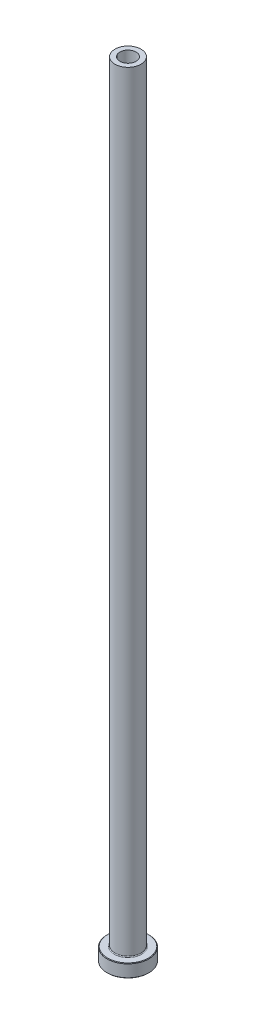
from build123d import *

# Parameters (mm, degrees)
FILLET1_R     = 0.3
CHAMFER1_SIZE = 0.2
CHAMFER3_SIZE = 0.5


with BuildPart() as part:
    # Sketch1 → Revolve1 (revolve)
    with BuildSketch(Plane.XY, mode=Mode.PRIVATE) as revolve1_sk:
        Polygon((-3.1, 300), (-5, 300), (-5, 5), (-8, 5), (-8, 0), (-3.35, 0), (-3.35, 243), (-3.1, 255), align=None)
    revolve(revolve1_sk.sketch.rotate(Axis((0, 92.187680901, 0), (0, -1, 0)), 270), axis=Axis((0, 92.187680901, 0), (0, -1, 0)))

    # Fillet1
    fillet1_edges = [part.edges().sort_by_distance(p)[0] for p in [
        (0, 5, -5),
    ]]
    fillet(fillet1_edges, radius=FILLET1_R)

    # Chamfer1
    chamfer1_edges = [part.edges().sort_by_distance(p)[0] for p in [
        (0, 0, -8),
        (0, 5, -8),
    ]]
    chamfer(chamfer1_edges, length=CHAMFER1_SIZE)

    # Chamfer3
    chamfer3_edges = [part.edges().sort_by_distance(p)[0] for p in [
        (0, 0, -3.35),
    ]]
    chamfer(chamfer3_edges, length=CHAMFER3_SIZE)


solid = part.part
